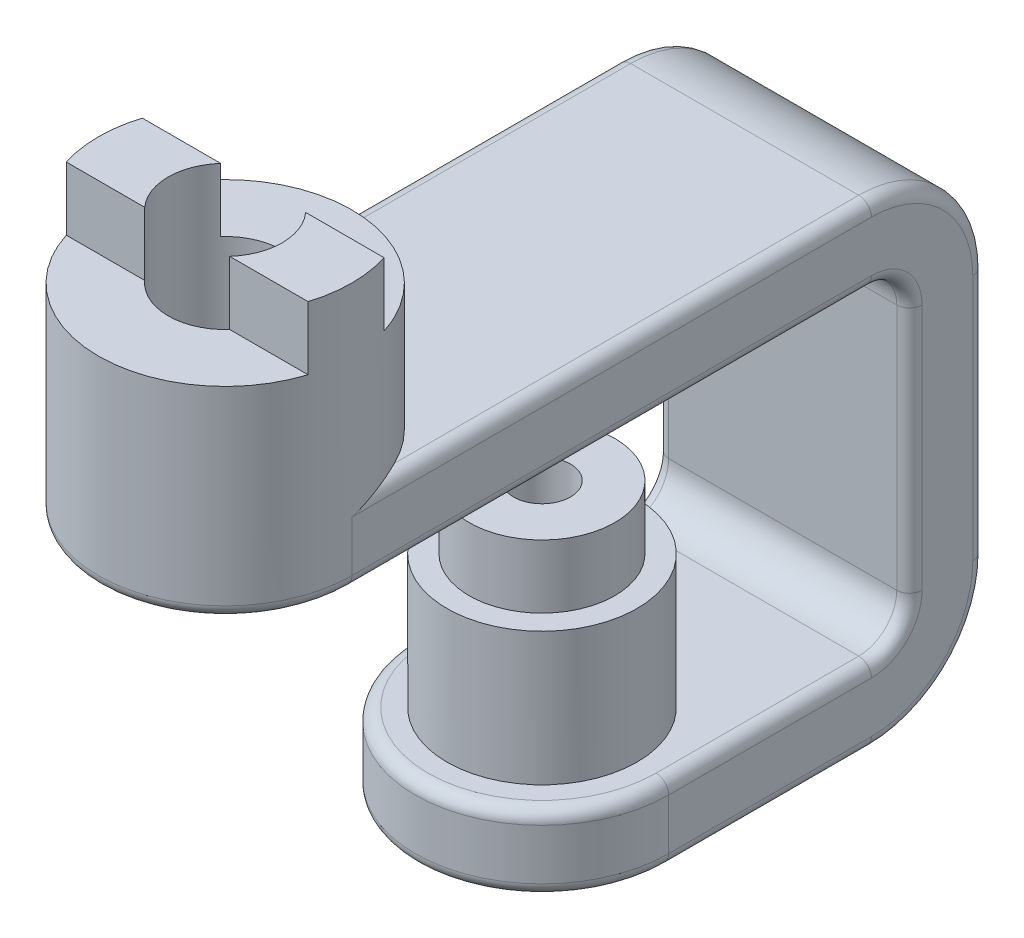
ISO-10303-21;
HEADER;
FILE_DESCRIPTION(('STEP AP214'),'2;1');
FILE_NAME('part.step','',(''),(''),'','','');
FILE_SCHEMA(('AUTOMOTIVE_DESIGN { 1 0 10303 214 1 1 1 1 }'));
ENDSEC;
DATA;
#1=APPLICATION_CONTEXT('core data for automotive mechanical design processes');
#2=APPLICATION_PROTOCOL_DEFINITION('international standard','automotive_design',2000,#1);
#3=PRODUCT_CONTEXT('',#1,'mechanical');
#4=PRODUCT('Part','Part','',(#3));
#5=PRODUCT_RELATED_PRODUCT_CATEGORY('part','',(#4));
#6=PRODUCT_DEFINITION_FORMATION('','',#4);
#7=PRODUCT_DEFINITION_CONTEXT('part definition',#1,'design');
#8=PRODUCT_DEFINITION('design','',#6,#7);
#9=PRODUCT_DEFINITION_SHAPE('','',#8);
#10=(LENGTH_UNIT() NAMED_UNIT(*) SI_UNIT(.MILLI.,.METRE.));
#11=(NAMED_UNIT(*) PLANE_ANGLE_UNIT() SI_UNIT($,.RADIAN.));
#12=(NAMED_UNIT(*) SI_UNIT($,.STERADIAN.) SOLID_ANGLE_UNIT());
#13=UNCERTAINTY_MEASURE_WITH_UNIT(LENGTH_MEASURE(1.E-05),#10,'distance_accuracy_value','');
#14=(GEOMETRIC_REPRESENTATION_CONTEXT(3) GLOBAL_UNCERTAINTY_ASSIGNED_CONTEXT((#13)) GLOBAL_UNIT_ASSIGNED_CONTEXT((#10,
#11,#12)) REPRESENTATION_CONTEXT('',''));
#15=CARTESIAN_POINT('',(0.,0.,0.));
#16=DIRECTION('',(0.,0.,1.));
#17=DIRECTION('',(1.,0.,0.));
#18=AXIS2_PLACEMENT_3D('',#15,#16,#17);
#19=CARTESIAN_POINT('',(20.,43.,-52.));
#20=DIRECTION('',(0.,-1.,0.));
#21=DIRECTION('',(0.,0.,-1.));
#22=AXIS2_PLACEMENT_3D('',#19,#20,#21);
#23=PLANE('',#22);
#24=CARTESIAN_POINT('',(0.,43.,-20.));
#25=DIRECTION('',(0.,-1.,0.));
#26=DIRECTION('',(0.,0.,-1.));
#27=AXIS2_PLACEMENT_3D('',#24,#25,#26);
#28=CIRCLE('',#27,11.5);
#29=CARTESIAN_POINT('',(0.,43.,-31.5));
#30=VERTEX_POINT('',#29);
#31=EDGE_CURVE('E283',#30,#30,#28,.T.);
#32=ORIENTED_EDGE('',*,*,#31,.F.);
#33=EDGE_LOOP('',(#32));
#34=FACE_BOUND('',#33,.T.);
#35=CARTESIAN_POINT('',(0.,43.,-20.));
#36=DIRECTION('',(0.,-1.,0.));
#37=DIRECTION('',(0.,0.,-1.));
#38=AXIS2_PLACEMENT_3D('',#35,#36,#37);
#39=CIRCLE('',#38,4.49999999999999);
#40=CARTESIAN_POINT('',(0.,43.,-24.5));
#41=VERTEX_POINT('',#40);
#42=EDGE_CURVE('E590',#41,#41,#39,.F.);
#43=ORIENTED_EDGE('',*,*,#42,.F.);
#44=EDGE_LOOP('',(#43));
#45=FACE_BOUND('',#44,.T.);
#46=ADVANCED_FACE('F36',(#34,#45),#23,.F.);
#47=CARTESIAN_POINT('',(0.,105.,30.));
#48=DIRECTION('',(0.,-1.,0.));
#49=DIRECTION('',(0.,0.,-1.));
#50=AXIS2_PLACEMENT_3D('',#47,#48,#49);
#51=PLANE('',#50);
#52=DIRECTION('',(1.,0.,0.));
#53=VECTOR('',#52,1.);
#54=CARTESIAN_POINT('',(-19.0787840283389,105.,24.));
#55=LINE('',#54,#53);
#56=CARTESIAN_POINT('',(6.70820393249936,105.,24.));
#57=VERTEX_POINT('',#56);
#58=CARTESIAN_POINT('',(19.0787840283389,105.,24.));
#59=VERTEX_POINT('',#58);
#60=EDGE_CURVE('E255',#57,#59,#55,.T.);
#61=ORIENTED_EDGE('',*,*,#60,.F.);
#62=CARTESIAN_POINT('',(0.,105.,30.));
#63=DIRECTION('',(0.,-1.,0.));
#64=DIRECTION('',(0.,0.,-1.));
#65=AXIS2_PLACEMENT_3D('',#62,#63,#64);
#66=CIRCLE('',#65,8.99999999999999);
#67=CARTESIAN_POINT('',(6.70820393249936,105.,36.));
#68=VERTEX_POINT('',#67);
#69=EDGE_CURVE('E247',#57,#68,#66,.T.);
#70=ORIENTED_EDGE('',*,*,#69,.T.);
#71=DIRECTION('',(-1.,0.,0.));
#72=VECTOR('',#71,1.);
#73=CARTESIAN_POINT('',(-19.0787840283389,105.,36.));
#74=LINE('',#73,#72);
#75=CARTESIAN_POINT('',(19.0787840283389,105.,36.));
#76=VERTEX_POINT('',#75);
#77=EDGE_CURVE('E263',#76,#68,#74,.T.);
#78=ORIENTED_EDGE('',*,*,#77,.F.);
#79=CARTESIAN_POINT('',(0.,105.,30.));
#80=DIRECTION('',(0.,-1.,0.));
#81=DIRECTION('',(0.,0.,-1.));
#82=AXIS2_PLACEMENT_3D('',#79,#80,#81);
#83=CIRCLE('',#82,20.);
#84=EDGE_CURVE('E293',#59,#76,#83,.T.);
#85=ORIENTED_EDGE('',*,*,#84,.F.);
#86=EDGE_LOOP('',(#61,#70,#78,#85));
#87=FACE_BOUND('',#86,.T.);
#88=ADVANCED_FACE('F261',(#87),#51,.F.);
#89=CARTESIAN_POINT('',(-19.0787840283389,95.,36.));
#90=DIRECTION('',(0.,0.,-1.));
#91=DIRECTION('',(-1.,0.,0.));
#92=AXIS2_PLACEMENT_3D('',#89,#90,#91);
#93=PLANE('',#92);
#94=ORIENTED_EDGE('',*,*,#77,.T.);
#95=DIRECTION('',(0.,-1.,0.));
#96=VECTOR('',#95,1.);
#97=CARTESIAN_POINT('',(6.70820393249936,63.,36.));
#98=LINE('',#97,#96);
#99=CARTESIAN_POINT('',(6.70820393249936,95.,36.));
#100=VERTEX_POINT('',#99);
#101=EDGE_CURVE('E244',#68,#100,#98,.T.);
#102=ORIENTED_EDGE('',*,*,#101,.T.);
#103=DIRECTION('',(-1.,0.,0.));
#104=VECTOR('',#103,1.);
#105=CARTESIAN_POINT('',(-19.0787840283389,95.,36.));
#106=LINE('',#105,#104);
#107=CARTESIAN_POINT('',(19.0787840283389,95.,36.));
#108=VERTEX_POINT('',#107);
#109=EDGE_CURVE('E279',#108,#100,#106,.T.);
#110=ORIENTED_EDGE('',*,*,#109,.F.);
#111=DIRECTION('',(0.,1.,0.));
#112=VECTOR('',#111,1.);
#113=CARTESIAN_POINT('',(19.0787840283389,95.,36.));
#114=LINE('',#113,#112);
#115=EDGE_CURVE('E270',#108,#76,#114,.T.);
#116=ORIENTED_EDGE('',*,*,#115,.T.);
#117=EDGE_LOOP('',(#94,#102,#110,#116));
#118=FACE_BOUND('',#117,.T.);
#119=ADVANCED_FACE('F268',(#118),#93,.F.);
#120=CARTESIAN_POINT('',(-19.0787840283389,95.,24.));
#121=DIRECTION('',(0.,0.,1.));
#122=DIRECTION('',(1.,0.,0.));
#123=AXIS2_PLACEMENT_3D('',#120,#121,#122);
#124=PLANE('',#123);
#125=CARTESIAN_POINT('',(-19.0787840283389,105.,24.));
#126=VERTEX_POINT('',#125);
#127=CARTESIAN_POINT('',(-6.70820393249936,105.,24.));
#128=VERTEX_POINT('',#127);
#129=EDGE_CURVE('E570',#126,#128,#55,.T.);
#130=ORIENTED_EDGE('',*,*,#129,.T.);
#131=DIRECTION('',(0.,-1.,0.));
#132=VECTOR('',#131,1.);
#133=CARTESIAN_POINT('',(-6.70820393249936,63.,24.));
#134=LINE('',#133,#132);
#135=CARTESIAN_POINT('',(-6.70820393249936,95.,24.));
#136=VERTEX_POINT('',#135);
#137=EDGE_CURVE('E341',#128,#136,#134,.T.);
#138=ORIENTED_EDGE('',*,*,#137,.T.);
#139=DIRECTION('',(1.,0.,0.));
#140=VECTOR('',#139,1.);
#141=CARTESIAN_POINT('',(-19.0787840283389,95.,24.));
#142=LINE('',#141,#140);
#143=CARTESIAN_POINT('',(-19.0787840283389,95.,24.));
#144=VERTEX_POINT('',#143);
#145=EDGE_CURVE('E571',#144,#136,#142,.T.);
#146=ORIENTED_EDGE('',*,*,#145,.F.);
#147=DIRECTION('',(0.,1.,0.));
#148=VECTOR('',#147,1.);
#149=CARTESIAN_POINT('',(-19.0787840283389,95.,24.));
#150=LINE('',#149,#148);
#151=EDGE_CURVE('E574',#144,#126,#150,.T.);
#152=ORIENTED_EDGE('',*,*,#151,.T.);
#153=EDGE_LOOP('',(#130,#138,#146,#152));
#154=FACE_BOUND('',#153,.T.);
#155=ADVANCED_FACE('F532',(#154),#124,.F.);
#156=CARTESIAN_POINT('',(20.,33.,-52.));
#157=DIRECTION('',(0.,-1.,0.));
#158=DIRECTION('',(0.,0.,-1.));
#159=AXIS2_PLACEMENT_3D('',#156,#157,#158);
#160=PLANE('',#159);
#161=CARTESIAN_POINT('',(0.,33.,-20.));
#162=DIRECTION('',(0.,-1.,0.));
#163=DIRECTION('',(0.,0.,-1.));
#164=AXIS2_PLACEMENT_3D('',#161,#162,#163);
#165=CIRCLE('',#164,15.);
#166=CARTESIAN_POINT('',(0.,33.,-35.));
#167=VERTEX_POINT('',#166);
#168=EDGE_CURVE('E290',#167,#167,#165,.T.);
#169=ORIENTED_EDGE('',*,*,#168,.F.);
#170=EDGE_LOOP('',(#169));
#171=FACE_BOUND('',#170,.T.);
#172=CARTESIAN_POINT('',(0.,33.,-20.));
#173=DIRECTION('',(0.,-1.,0.));
#174=DIRECTION('',(0.,0.,-1.));
#175=AXIS2_PLACEMENT_3D('',#172,#173,#174);
#176=CIRCLE('',#175,11.5);
#177=CARTESIAN_POINT('',(0.,33.,-31.5));
#178=VERTEX_POINT('',#177);
#179=EDGE_CURVE('E336',#178,#178,#176,.F.);
#180=ORIENTED_EDGE('',*,*,#179,.F.);
#181=EDGE_LOOP('',(#180));
#182=FACE_BOUND('',#181,.T.);
#183=ADVANCED_FACE('F489',(#171,#182),#160,.F.);
#184=CARTESIAN_POINT('',(20.,12.,0.));
#185=DIRECTION('',(0.,1.,0.));
#186=DIRECTION('',(0.,0.,1.));
#187=AXIS2_PLACEMENT_3D('',#184,#185,#186);
#188=PLANE('',#187);
#189=DIRECTION('',(-1.,0.,0.));
#190=VECTOR('',#189,1.);
#191=CARTESIAN_POINT('',(20.,12.,-52.));
#192=LINE('',#191,#190);
#193=CARTESIAN_POINT('',(18.,12.,-52.));
#194=VERTEX_POINT('',#193);
#195=CARTESIAN_POINT('',(-18.,12.,-52.));
#196=VERTEX_POINT('',#195);
#197=EDGE_CURVE('E318',#194,#196,#192,.T.);
#198=ORIENTED_EDGE('',*,*,#197,.T.);
#199=DIRECTION('',(0.,0.,-1.));
#200=VECTOR('',#199,1.);
#201=CARTESIAN_POINT('',(-18.,12.,-20.));
#202=LINE('',#201,#200);
#203=CARTESIAN_POINT('',(-18.,12.,-20.));
#204=VERTEX_POINT('',#203);
#205=EDGE_CURVE('E417',#196,#204,#202,.F.);
#206=ORIENTED_EDGE('',*,*,#205,.T.);
#207=CARTESIAN_POINT('',(0.,12.,-20.));
#208=DIRECTION('',(0.,1.,0.));
#209=DIRECTION('',(0.,0.,1.));
#210=AXIS2_PLACEMENT_3D('',#207,#208,#209);
#211=CIRCLE('',#210,18.);
#212=CARTESIAN_POINT('',(18.,12.,-20.));
#213=VERTEX_POINT('',#212);
#214=EDGE_CURVE('E414',#204,#213,#211,.T.);
#215=ORIENTED_EDGE('',*,*,#214,.T.);
#216=DIRECTION('',(0.,0.,-1.));
#217=VECTOR('',#216,1.);
#218=CARTESIAN_POINT('',(18.,12.,0.));
#219=LINE('',#218,#217);
#220=EDGE_CURVE('E412',#213,#194,#219,.T.);
#221=ORIENTED_EDGE('',*,*,#220,.T.);
#222=EDGE_LOOP('',(#198,#206,#215,#221));
#223=FACE_BOUND('',#222,.T.);
#224=CARTESIAN_POINT('',(0.,12.,-20.));
#225=DIRECTION('',(0.,1.,0.));
#226=DIRECTION('',(0.,0.,1.));
#227=AXIS2_PLACEMENT_3D('',#224,#225,#226);
#228=CIRCLE('',#227,15.);
#229=CARTESIAN_POINT('',(0.,12.,-5.));
#230=VERTEX_POINT('',#229);
#231=EDGE_CURVE('E287',#230,#230,#228,.T.);
#232=ORIENTED_EDGE('',*,*,#231,.F.);
#233=EDGE_LOOP('',(#232));
#234=FACE_BOUND('',#233,.T.);
#235=ADVANCED_FACE('F485',(#223,#234),#188,.T.);
#236=CARTESIAN_POINT('',(0.,12.,-20.));
#237=DIRECTION('',(0.,1.,0.));
#238=DIRECTION('',(0.,0.,1.));
#239=AXIS2_PLACEMENT_3D('',#236,#237,#238);
#240=CYLINDRICAL_SURFACE('',#239,20.);
#241=DIRECTION('',(0.,-1.,0.));
#242=VECTOR('',#241,1.);
#243=CARTESIAN_POINT('',(-20.,12.,-20.));
#244=LINE('',#243,#242);
#245=CARTESIAN_POINT('',(-20.,2.,-20.));
#246=VERTEX_POINT('',#245);
#247=CARTESIAN_POINT('',(-20.,10.,-20.));
#248=VERTEX_POINT('',#247);
#249=EDGE_CURVE('E333',#246,#248,#244,.F.);
#250=ORIENTED_EDGE('',*,*,#249,.F.);
#251=CARTESIAN_POINT('',(0.,2.,-20.));
#252=DIRECTION('',(0.,1.,0.));
#253=DIRECTION('',(0.,0.,1.));
#254=AXIS2_PLACEMENT_3D('',#251,#252,#253);
#255=CIRCLE('',#254,20.);
#256=CARTESIAN_POINT('',(20.,2.,-20.));
#257=VERTEX_POINT('',#256);
#258=EDGE_CURVE('E390',#246,#257,#255,.T.);
#259=ORIENTED_EDGE('',*,*,#258,.T.);
#260=DIRECTION('',(0.,1.,0.));
#261=VECTOR('',#260,1.);
#262=CARTESIAN_POINT('',(20.,57.,-20.));
#263=LINE('',#262,#261);
#264=CARTESIAN_POINT('',(20.,10.,-20.));
#265=VERTEX_POINT('',#264);
#266=EDGE_CURVE('E330',#265,#257,#263,.F.);
#267=ORIENTED_EDGE('',*,*,#266,.F.);
#268=CARTESIAN_POINT('',(0.,10.,-20.));
#269=DIRECTION('',(0.,1.,0.));
#270=DIRECTION('',(0.,0.,1.));
#271=AXIS2_PLACEMENT_3D('',#268,#269,#270);
#272=CIRCLE('',#271,20.);
#273=EDGE_CURVE('E387',#265,#248,#272,.F.);
#274=ORIENTED_EDGE('',*,*,#273,.T.);
#275=EDGE_LOOP('',(#250,#259,#267,#274));
#276=FACE_BOUND('',#275,.T.);
#277=ADVANCED_FACE('F488',(#276),#240,.T.);
#278=CARTESIAN_POINT('',(20.,75.,-52.));
#279=DIRECTION('',(0.,-1.,0.));
#280=DIRECTION('',(0.,0.,-1.));
#281=AXIS2_PLACEMENT_3D('',#278,#279,#280);
#282=PLANE('',#281);
#283=DIRECTION('',(-1.,0.,0.));
#284=VECTOR('',#283,1.);
#285=CARTESIAN_POINT('',(20.,75.,-52.));
#286=LINE('',#285,#284);
#287=CARTESIAN_POINT('',(18.,75.,-52.));
#288=VERTEX_POINT('',#287);
#289=CARTESIAN_POINT('',(-18.,75.,-52.));
#290=VERTEX_POINT('',#289);
#291=EDGE_CURVE('E304',#288,#290,#286,.T.);
#292=ORIENTED_EDGE('',*,*,#291,.T.);
#293=DIRECTION('',(0.,0.,1.));
#294=VECTOR('',#293,1.);
#295=CARTESIAN_POINT('',(-18.,75.,-52.));
#296=LINE('',#295,#294);
#297=CARTESIAN_POINT('',(-18.,75.,21.2822021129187));
#298=VERTEX_POINT('',#297);
#299=EDGE_CURVE('E346',#290,#298,#296,.T.);
#300=ORIENTED_EDGE('',*,*,#299,.T.);
#301=CARTESIAN_POINT('',(0.,75.,30.));
#302=DIRECTION('',(0.,-1.,0.));
#303=DIRECTION('',(0.,0.,-1.));
#304=AXIS2_PLACEMENT_3D('',#301,#302,#303);
#305=CIRCLE('',#304,20.);
#306=CARTESIAN_POINT('',(18.,75.,21.2822021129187));
#307=VERTEX_POINT('',#306);
#308=EDGE_CURVE('E297',#298,#307,#305,.T.);
#309=ORIENTED_EDGE('',*,*,#308,.T.);
#310=DIRECTION('',(0.,0.,1.));
#311=VECTOR('',#310,1.);
#312=CARTESIAN_POINT('',(18.,75.,-52.));
#313=LINE('',#312,#311);
#314=EDGE_CURVE('E344',#307,#288,#313,.F.);
#315=ORIENTED_EDGE('',*,*,#314,.T.);
#316=EDGE_LOOP('',(#292,#300,#309,#315));
#317=FACE_BOUND('',#316,.T.);
#318=ADVANCED_FACE('F505',(#317),#282,.F.);
#319=CARTESIAN_POINT('',(20.,63.,-52.));
#320=DIRECTION('',(0.,-1.,0.));
#321=DIRECTION('',(0.,0.,-1.));
#322=AXIS2_PLACEMENT_3D('',#319,#320,#321);
#323=PLANE('',#322);
#324=CARTESIAN_POINT('',(0.,63.,30.));
#325=DIRECTION('',(0.,-1.,0.));
#326=DIRECTION('',(0.,0.,-1.));
#327=AXIS2_PLACEMENT_3D('',#324,#325,#326);
#328=CIRCLE('',#327,8.99999999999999);
#329=CARTESIAN_POINT('',(0.,63.,21.));
#330=VERTEX_POINT('',#329);
#331=EDGE_CURVE('E588',#330,#330,#328,.T.);
#332=ORIENTED_EDGE('',*,*,#331,.F.);
#333=EDGE_LOOP('',(#332));
#334=FACE_BOUND('',#333,.T.);
#335=CARTESIAN_POINT('',(0.,63.,30.));
#336=DIRECTION('',(0.,-1.,0.));
#337=DIRECTION('',(0.,0.,-1.));
#338=AXIS2_PLACEMENT_3D('',#335,#336,#337);
#339=CIRCLE('',#338,18.);
#340=CARTESIAN_POINT('',(18.,63.,30.));
#341=VERTEX_POINT('',#340);
#342=CARTESIAN_POINT('',(-18.,63.,30.));
#343=VERTEX_POINT('',#342);
#344=EDGE_CURVE('E53',#341,#343,#339,.T.);
#345=ORIENTED_EDGE('',*,*,#344,.T.);
#346=DIRECTION('',(0.,0.,1.));
#347=VECTOR('',#346,1.);
#348=CARTESIAN_POINT('',(-18.,63.,-52.));
#349=LINE('',#348,#347);
#350=CARTESIAN_POINT('',(-18.,63.,-52.));
#351=VERTEX_POINT('',#350);
#352=EDGE_CURVE('E433',#343,#351,#349,.F.);
#353=ORIENTED_EDGE('',*,*,#352,.T.);
#354=DIRECTION('',(-1.,0.,0.));
#355=VECTOR('',#354,1.);
#356=CARTESIAN_POINT('',(20.,63.,-52.));
#357=LINE('',#356,#355);
#358=CARTESIAN_POINT('',(18.,63.,-52.));
#359=VERTEX_POINT('',#358);
#360=EDGE_CURVE('E327',#359,#351,#357,.T.);
#361=ORIENTED_EDGE('',*,*,#360,.F.);
#362=DIRECTION('',(0.,0.,1.));
#363=VECTOR('',#362,1.);
#364=CARTESIAN_POINT('',(18.,63.,-52.));
#365=LINE('',#364,#363);
#366=EDGE_CURVE('E58',#359,#341,#365,.T.);
#367=ORIENTED_EDGE('',*,*,#366,.T.);
#368=EDGE_LOOP('',(#345,#353,#361,#367));
#369=FACE_BOUND('',#368,.T.);
#370=ADVANCED_FACE('F501',(#334,#369),#323,.T.);
#371=CARTESIAN_POINT('',(20.,57.,-52.));
#372=DIRECTION('',(-1.,0.,0.));
#373=DIRECTION('',(0.,0.,1.));
#374=AXIS2_PLACEMENT_3D('',#371,#372,#373);
#375=CYLINDRICAL_SURFACE('',#374,6.);
#376=ORIENTED_EDGE('',*,*,#360,.T.);
#377=CARTESIAN_POINT('',(-18.,57.,-52.));
#378=DIRECTION('',(1.,0.,0.));
#379=DIRECTION('',(0.,0.,-1.));
#380=AXIS2_PLACEMENT_3D('',#377,#378,#379);
#381=CIRCLE('',#380,6.);
#382=CARTESIAN_POINT('',(-18.,57.,-58.));
#383=VERTEX_POINT('',#382);
#384=EDGE_CURVE('E429',#351,#383,#381,.F.);
#385=ORIENTED_EDGE('',*,*,#384,.T.);
#386=DIRECTION('',(-1.,0.,0.));
#387=VECTOR('',#386,1.);
#388=CARTESIAN_POINT('',(20.,57.,-58.));
#389=LINE('',#388,#387);
#390=CARTESIAN_POINT('',(18.,57.,-58.));
#391=VERTEX_POINT('',#390);
#392=EDGE_CURVE('E324',#391,#383,#389,.T.);
#393=ORIENTED_EDGE('',*,*,#392,.F.);
#394=CARTESIAN_POINT('',(18.,57.,-52.));
#395=DIRECTION('',(1.,0.,0.));
#396=DIRECTION('',(0.,0.,-1.));
#397=AXIS2_PLACEMENT_3D('',#394,#395,#396);
#398=CIRCLE('',#397,6.);
#399=EDGE_CURVE('E427',#391,#359,#398,.T.);
#400=ORIENTED_EDGE('',*,*,#399,.T.);
#401=EDGE_LOOP('',(#376,#385,#393,#400));
#402=FACE_BOUND('',#401,.T.);
#403=ADVANCED_FACE('F497',(#402),#375,.F.);
#404=CARTESIAN_POINT('',(20.,18.,-58.));
#405=DIRECTION('',(0.,0.,1.));
#406=DIRECTION('',(1.,0.,0.));
#407=AXIS2_PLACEMENT_3D('',#404,#405,#406);
#408=PLANE('',#407);
#409=ORIENTED_EDGE('',*,*,#392,.T.);
#410=DIRECTION('',(0.,1.,0.));
#411=VECTOR('',#410,1.);
#412=CARTESIAN_POINT('',(-18.,18.,-58.));
#413=LINE('',#412,#411);
#414=CARTESIAN_POINT('',(-18.,18.,-58.));
#415=VERTEX_POINT('',#414);
#416=EDGE_CURVE('E425',#383,#415,#413,.F.);
#417=ORIENTED_EDGE('',*,*,#416,.T.);
#418=DIRECTION('',(-1.,0.,0.));
#419=VECTOR('',#418,1.);
#420=CARTESIAN_POINT('',(20.,18.,-58.));
#421=LINE('',#420,#419);
#422=CARTESIAN_POINT('',(18.,18.,-58.));
#423=VERTEX_POINT('',#422);
#424=EDGE_CURVE('E321',#423,#415,#421,.T.);
#425=ORIENTED_EDGE('',*,*,#424,.F.);
#426=DIRECTION('',(0.,1.,0.));
#427=VECTOR('',#426,1.);
#428=CARTESIAN_POINT('',(18.,18.,-58.));
#429=LINE('',#428,#427);
#430=EDGE_CURVE('E423',#423,#391,#429,.T.);
#431=ORIENTED_EDGE('',*,*,#430,.T.);
#432=EDGE_LOOP('',(#409,#417,#425,#431));
#433=FACE_BOUND('',#432,.T.);
#434=ADVANCED_FACE('F493',(#433),#408,.T.);
#435=CARTESIAN_POINT('',(20.,18.,-52.));
#436=DIRECTION('',(-1.,0.,0.));
#437=DIRECTION('',(0.,0.,1.));
#438=AXIS2_PLACEMENT_3D('',#435,#436,#437);
#439=CYLINDRICAL_SURFACE('',#438,5.99999999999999);
#440=ORIENTED_EDGE('',*,*,#424,.T.);
#441=CARTESIAN_POINT('',(-18.,18.,-52.));
#442=DIRECTION('',(1.,0.,0.));
#443=DIRECTION('',(0.,0.,-1.));
#444=AXIS2_PLACEMENT_3D('',#441,#442,#443);
#445=CIRCLE('',#444,5.99999999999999);
#446=EDGE_CURVE('E421',#415,#196,#445,.F.);
#447=ORIENTED_EDGE('',*,*,#446,.T.);
#448=ORIENTED_EDGE('',*,*,#197,.F.);
#449=CARTESIAN_POINT('',(18.,18.,-52.));
#450=DIRECTION('',(1.,0.,0.));
#451=DIRECTION('',(0.,0.,-1.));
#452=AXIS2_PLACEMENT_3D('',#449,#450,#451);
#453=CIRCLE('',#452,5.99999999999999);
#454=EDGE_CURVE('E419',#194,#423,#453,.T.);
#455=ORIENTED_EDGE('',*,*,#454,.T.);
#456=EDGE_LOOP('',(#440,#447,#448,#455));
#457=FACE_BOUND('',#456,.T.);
#458=ADVANCED_FACE('F483',(#457),#439,.F.);
#459=CARTESIAN_POINT('',(20.,0.,0.));
#460=DIRECTION('',(0.,1.,0.));
#461=DIRECTION('',(0.,0.,1.));
#462=AXIS2_PLACEMENT_3D('',#459,#460,#461);
#463=PLANE('',#462);
#464=CARTESIAN_POINT('',(0.,0.,-20.));
#465=DIRECTION('',(0.,-1.,0.));
#466=DIRECTION('',(0.,0.,-1.));
#467=AXIS2_PLACEMENT_3D('',#464,#465,#466);
#468=CIRCLE('',#467,9.005);
#469=CARTESIAN_POINT('',(0.,0.,-29.005));
#470=VERTEX_POINT('',#469);
#471=EDGE_CURVE('E599',#470,#470,#468,.T.);
#472=ORIENTED_EDGE('',*,*,#471,.F.);
#473=EDGE_LOOP('',(#472));
#474=FACE_BOUND('',#473,.T.);
#475=CARTESIAN_POINT('',(0.,0.,-20.));
#476=DIRECTION('',(0.,1.,0.));
#477=DIRECTION('',(0.,0.,1.));
#478=AXIS2_PLACEMENT_3D('',#475,#476,#477);
#479=CIRCLE('',#478,18.);
#480=CARTESIAN_POINT('',(18.,0.,-20.));
#481=VERTEX_POINT('',#480);
#482=CARTESIAN_POINT('',(-18.,0.,-20.));
#483=VERTEX_POINT('',#482);
#484=EDGE_CURVE('E383',#481,#483,#479,.F.);
#485=ORIENTED_EDGE('',*,*,#484,.T.);
#486=DIRECTION('',(0.,0.,-1.));
#487=VECTOR('',#486,1.);
#488=CARTESIAN_POINT('',(-18.,0.,0.));
#489=LINE('',#488,#487);
#490=CARTESIAN_POINT('',(-18.,0.,-52.));
#491=VERTEX_POINT('',#490);
#492=EDGE_CURVE('E385',#483,#491,#489,.T.);
#493=ORIENTED_EDGE('',*,*,#492,.T.);
#494=DIRECTION('',(-1.,0.,0.));
#495=VECTOR('',#494,1.);
#496=CARTESIAN_POINT('',(20.,0.,-52.));
#497=LINE('',#496,#495);
#498=CARTESIAN_POINT('',(18.,0.,-52.));
#499=VERTEX_POINT('',#498);
#500=EDGE_CURVE('E315',#499,#491,#497,.T.);
#501=ORIENTED_EDGE('',*,*,#500,.F.);
#502=DIRECTION('',(0.,0.,-1.));
#503=VECTOR('',#502,1.);
#504=CARTESIAN_POINT('',(18.,0.,-20.));
#505=LINE('',#504,#503);
#506=EDGE_CURVE('E381',#499,#481,#505,.F.);
#507=ORIENTED_EDGE('',*,*,#506,.T.);
#508=EDGE_LOOP('',(#485,#493,#501,#507));
#509=FACE_BOUND('',#508,.T.);
#510=ADVANCED_FACE('F479',(#474,#509),#463,.F.);
#511=CARTESIAN_POINT('',(20.,18.,-52.));
#512=DIRECTION('',(-1.,0.,0.));
#513=DIRECTION('',(0.,0.,1.));
#514=AXIS2_PLACEMENT_3D('',#511,#512,#513);
#515=CYLINDRICAL_SURFACE('',#514,18.);
#516=ORIENTED_EDGE('',*,*,#500,.T.);
#517=CARTESIAN_POINT('',(-18.,18.,-52.));
#518=DIRECTION('',(1.,0.,0.));
#519=DIRECTION('',(0.,0.,-1.));
#520=AXIS2_PLACEMENT_3D('',#517,#518,#519);
#521=CIRCLE('',#520,18.);
#522=CARTESIAN_POINT('',(-18.,18.,-70.));
#523=VERTEX_POINT('',#522);
#524=EDGE_CURVE('E379',#491,#523,#521,.T.);
#525=ORIENTED_EDGE('',*,*,#524,.T.);
#526=DIRECTION('',(-1.,0.,0.));
#527=VECTOR('',#526,1.);
#528=CARTESIAN_POINT('',(20.,18.,-70.));
#529=LINE('',#528,#527);
#530=CARTESIAN_POINT('',(18.,18.,-70.));
#531=VERTEX_POINT('',#530);
#532=EDGE_CURVE('E312',#531,#523,#529,.T.);
#533=ORIENTED_EDGE('',*,*,#532,.F.);
#534=CARTESIAN_POINT('',(18.,18.,-52.));
#535=DIRECTION('',(1.,0.,0.));
#536=DIRECTION('',(0.,0.,-1.));
#537=AXIS2_PLACEMENT_3D('',#534,#535,#536);
#538=CIRCLE('',#537,18.);
#539=EDGE_CURVE('E377',#531,#499,#538,.F.);
#540=ORIENTED_EDGE('',*,*,#539,.T.);
#541=EDGE_LOOP('',(#516,#525,#533,#540));
#542=FACE_BOUND('',#541,.T.);
#543=ADVANCED_FACE('F475',(#542),#515,.T.);
#544=CARTESIAN_POINT('',(20.,18.,-70.));
#545=DIRECTION('',(0.,0.,1.));
#546=DIRECTION('',(1.,0.,0.));
#547=AXIS2_PLACEMENT_3D('',#544,#545,#546);
#548=PLANE('',#547);
#549=ORIENTED_EDGE('',*,*,#532,.T.);
#550=DIRECTION('',(0.,1.,0.));
#551=VECTOR('',#550,1.);
#552=CARTESIAN_POINT('',(-18.,18.,-70.));
#553=LINE('',#552,#551);
#554=CARTESIAN_POINT('',(-18.,57.,-70.));
#555=VERTEX_POINT('',#554);
#556=EDGE_CURVE('E375',#523,#555,#553,.T.);
#557=ORIENTED_EDGE('',*,*,#556,.T.);
#558=DIRECTION('',(-1.,0.,0.));
#559=VECTOR('',#558,1.);
#560=CARTESIAN_POINT('',(20.,57.,-70.));
#561=LINE('',#560,#559);
#562=CARTESIAN_POINT('',(18.,57.,-70.));
#563=VERTEX_POINT('',#562);
#564=EDGE_CURVE('E309',#563,#555,#561,.T.);
#565=ORIENTED_EDGE('',*,*,#564,.F.);
#566=DIRECTION('',(0.,1.,0.));
#567=VECTOR('',#566,1.);
#568=CARTESIAN_POINT('',(18.,18.,-70.));
#569=LINE('',#568,#567);
#570=EDGE_CURVE('E373',#563,#531,#569,.F.);
#571=ORIENTED_EDGE('',*,*,#570,.T.);
#572=EDGE_LOOP('',(#549,#557,#565,#571));
#573=FACE_BOUND('',#572,.T.);
#574=ADVANCED_FACE('F471',(#573),#548,.F.);
#575=CARTESIAN_POINT('',(20.,57.,-52.));
#576=DIRECTION('',(-1.,0.,0.));
#577=DIRECTION('',(0.,0.,1.));
#578=AXIS2_PLACEMENT_3D('',#575,#576,#577);
#579=CYLINDRICAL_SURFACE('',#578,18.);
#580=ORIENTED_EDGE('',*,*,#564,.T.);
#581=CARTESIAN_POINT('',(-18.,57.,-52.));
#582=DIRECTION('',(1.,0.,0.));
#583=DIRECTION('',(0.,0.,-1.));
#584=AXIS2_PLACEMENT_3D('',#581,#582,#583);
#585=CIRCLE('',#584,18.);
#586=EDGE_CURVE('E371',#555,#290,#585,.T.);
#587=ORIENTED_EDGE('',*,*,#586,.T.);
#588=ORIENTED_EDGE('',*,*,#291,.F.);
#589=CARTESIAN_POINT('',(18.,57.,-52.));
#590=DIRECTION('',(1.,0.,0.));
#591=DIRECTION('',(0.,0.,-1.));
#592=AXIS2_PLACEMENT_3D('',#589,#590,#591);
#593=CIRCLE('',#592,18.);
#594=EDGE_CURVE('E369',#288,#563,#593,.F.);
#595=ORIENTED_EDGE('',*,*,#594,.T.);
#596=EDGE_LOOP('',(#580,#587,#588,#595));
#597=FACE_BOUND('',#596,.T.);
#598=ADVANCED_FACE('F464',(#597),#579,.T.);
#599=CARTESIAN_POINT('',(20.,57.,-52.));
#600=DIRECTION('',(1.,0.,0.));
#601=DIRECTION('',(0.,0.,-1.));
#602=AXIS2_PLACEMENT_3D('',#599,#600,#601);
#603=PLANE('',#602);
#604=CARTESIAN_POINT('',(20.,57.,-52.));
#605=DIRECTION('',(1.,0.,0.));
#606=DIRECTION('',(0.,0.,-1.));
#607=AXIS2_PLACEMENT_3D('',#604,#605,#606);
#608=CIRCLE('',#607,16.);
#609=CARTESIAN_POINT('',(20.,57.,-68.));
#610=VERTEX_POINT('',#609);
#611=CARTESIAN_POINT('',(20.,73.,-52.));
#612=VERTEX_POINT('',#611);
#613=EDGE_CURVE('E408',#610,#612,#608,.T.);
#614=ORIENTED_EDGE('',*,*,#613,.T.);
#615=DIRECTION('',(0.,0.,1.));
#616=VECTOR('',#615,1.);
#617=CARTESIAN_POINT('',(20.,73.,30.));
#618=LINE('',#617,#616);
#619=CARTESIAN_POINT('',(20.,73.,30.));
#620=VERTEX_POINT('',#619);
#621=EDGE_CURVE('E410',#612,#620,#618,.T.);
#622=ORIENTED_EDGE('',*,*,#621,.T.);
#623=DIRECTION('',(0.,1.,0.));
#624=VECTOR('',#623,1.);
#625=CARTESIAN_POINT('',(20.,63.,30.));
#626=LINE('',#625,#624);
#627=CARTESIAN_POINT('',(20.,65.,30.));
#628=VERTEX_POINT('',#627);
#629=EDGE_CURVE('E301',#628,#620,#626,.T.);
#630=ORIENTED_EDGE('',*,*,#629,.F.);
#631=DIRECTION('',(0.,0.,1.));
#632=VECTOR('',#631,1.);
#633=CARTESIAN_POINT('',(20.,65.,-52.));
#634=LINE('',#633,#632);
#635=CARTESIAN_POINT('',(20.,65.,-52.));
#636=VERTEX_POINT('',#635);
#637=EDGE_CURVE('E400',#628,#636,#634,.F.);
#638=ORIENTED_EDGE('',*,*,#637,.T.);
#639=CARTESIAN_POINT('',(20.,57.,-52.));
#640=DIRECTION('',(1.,0.,0.));
#641=DIRECTION('',(0.,0.,-1.));
#642=AXIS2_PLACEMENT_3D('',#639,#640,#641);
#643=CIRCLE('',#642,8.);
#644=CARTESIAN_POINT('',(20.,57.,-60.));
#645=VERTEX_POINT('',#644);
#646=EDGE_CURVE('E398',#636,#645,#643,.F.);
#647=ORIENTED_EDGE('',*,*,#646,.T.);
#648=DIRECTION('',(0.,1.,0.));
#649=VECTOR('',#648,1.);
#650=CARTESIAN_POINT('',(20.,57.,-60.));
#651=LINE('',#650,#649);
#652=CARTESIAN_POINT('',(20.,18.,-60.));
#653=VERTEX_POINT('',#652);
#654=EDGE_CURVE('E396',#645,#653,#651,.F.);
#655=ORIENTED_EDGE('',*,*,#654,.T.);
#656=CARTESIAN_POINT('',(20.,18.,-52.));
#657=DIRECTION('',(1.,0.,0.));
#658=DIRECTION('',(0.,0.,-1.));
#659=AXIS2_PLACEMENT_3D('',#656,#657,#658);
#660=CIRCLE('',#659,7.99999999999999);
#661=CARTESIAN_POINT('',(20.,10.,-52.));
#662=VERTEX_POINT('',#661);
#663=EDGE_CURVE('E394',#653,#662,#660,.F.);
#664=ORIENTED_EDGE('',*,*,#663,.T.);
#665=DIRECTION('',(0.,0.,-1.));
#666=VECTOR('',#665,1.);
#667=CARTESIAN_POINT('',(20.,10.,-52.));
#668=LINE('',#667,#666);
#669=EDGE_CURVE('E392',#662,#265,#668,.F.);
#670=ORIENTED_EDGE('',*,*,#669,.T.);
#671=ORIENTED_EDGE('',*,*,#266,.T.);
#672=DIRECTION('',(0.,0.,-1.));
#673=VECTOR('',#672,1.);
#674=CARTESIAN_POINT('',(20.,2.,-52.));
#675=LINE('',#674,#673);
#676=CARTESIAN_POINT('',(20.,2.,-52.));
#677=VERTEX_POINT('',#676);
#678=EDGE_CURVE('E402',#257,#677,#675,.T.);
#679=ORIENTED_EDGE('',*,*,#678,.T.);
#680=CARTESIAN_POINT('',(20.,18.,-52.));
#681=DIRECTION('',(1.,0.,0.));
#682=DIRECTION('',(0.,0.,-1.));
#683=AXIS2_PLACEMENT_3D('',#680,#681,#682);
#684=CIRCLE('',#683,16.);
#685=CARTESIAN_POINT('',(20.,18.,-68.));
#686=VERTEX_POINT('',#685);
#687=EDGE_CURVE('E404',#677,#686,#684,.T.);
#688=ORIENTED_EDGE('',*,*,#687,.T.);
#689=DIRECTION('',(0.,1.,0.));
#690=VECTOR('',#689,1.);
#691=CARTESIAN_POINT('',(20.,57.,-68.));
#692=LINE('',#691,#690);
#693=EDGE_CURVE('E406',#686,#610,#692,.T.);
#694=ORIENTED_EDGE('',*,*,#693,.T.);
#695=EDGE_LOOP('',(#614,#622,#630,#638,#647,#655,#664,#670,#671,#679,#688,#694));
#696=FACE_BOUND('',#695,.T.);
#697=ADVANCED_FACE('F460',(#696),#603,.T.);
#698=CARTESIAN_POINT('',(-20.,57.,-52.));
#699=DIRECTION('',(1.,0.,0.));
#700=DIRECTION('',(0.,0.,-1.));
#701=AXIS2_PLACEMENT_3D('',#698,#699,#700);
#702=PLANE('',#701);
#703=DIRECTION('',(0.,1.,0.));
#704=VECTOR('',#703,1.);
#705=CARTESIAN_POINT('',(-20.,63.,30.));
#706=LINE('',#705,#704);
#707=CARTESIAN_POINT('',(-20.,65.,30.));
#708=VERTEX_POINT('',#707);
#709=CARTESIAN_POINT('',(-20.,73.,30.));
#710=VERTEX_POINT('',#709);
#711=EDGE_CURVE('E300',#708,#710,#706,.T.);
#712=ORIENTED_EDGE('',*,*,#711,.T.);
#713=DIRECTION('',(0.,0.,1.));
#714=VECTOR('',#713,1.);
#715=CARTESIAN_POINT('',(-20.,73.,-52.));
#716=LINE('',#715,#714);
#717=CARTESIAN_POINT('',(-20.,73.,-52.));
#718=VERTEX_POINT('',#717);
#719=EDGE_CURVE('E367',#710,#718,#716,.F.);
#720=ORIENTED_EDGE('',*,*,#719,.T.);
#721=CARTESIAN_POINT('',(-20.,57.,-52.));
#722=DIRECTION('',(1.,0.,0.));
#723=DIRECTION('',(0.,0.,-1.));
#724=AXIS2_PLACEMENT_3D('',#721,#722,#723);
#725=CIRCLE('',#724,16.);
#726=CARTESIAN_POINT('',(-20.,57.,-68.));
#727=VERTEX_POINT('',#726);
#728=EDGE_CURVE('E365',#718,#727,#725,.F.);
#729=ORIENTED_EDGE('',*,*,#728,.T.);
#730=DIRECTION('',(0.,1.,0.));
#731=VECTOR('',#730,1.);
#732=CARTESIAN_POINT('',(-20.,57.,-68.));
#733=LINE('',#732,#731);
#734=CARTESIAN_POINT('',(-20.,18.,-68.));
#735=VERTEX_POINT('',#734);
#736=EDGE_CURVE('E363',#727,#735,#733,.F.);
#737=ORIENTED_EDGE('',*,*,#736,.T.);
#738=CARTESIAN_POINT('',(-20.,18.,-52.));
#739=DIRECTION('',(1.,0.,0.));
#740=DIRECTION('',(0.,0.,-1.));
#741=AXIS2_PLACEMENT_3D('',#738,#739,#740);
#742=CIRCLE('',#741,16.);
#743=CARTESIAN_POINT('',(-20.,2.,-52.));
#744=VERTEX_POINT('',#743);
#745=EDGE_CURVE('E361',#735,#744,#742,.F.);
#746=ORIENTED_EDGE('',*,*,#745,.T.);
#747=DIRECTION('',(0.,0.,-1.));
#748=VECTOR('',#747,1.);
#749=CARTESIAN_POINT('',(-20.,2.,-52.));
#750=LINE('',#749,#748);
#751=EDGE_CURVE('E359',#744,#246,#750,.F.);
#752=ORIENTED_EDGE('',*,*,#751,.T.);
#753=ORIENTED_EDGE('',*,*,#249,.T.);
#754=DIRECTION('',(0.,0.,-1.));
#755=VECTOR('',#754,1.);
#756=CARTESIAN_POINT('',(-20.,10.,-52.));
#757=LINE('',#756,#755);
#758=CARTESIAN_POINT('',(-20.,10.,-52.));
#759=VERTEX_POINT('',#758);
#760=EDGE_CURVE('E357',#248,#759,#757,.T.);
#761=ORIENTED_EDGE('',*,*,#760,.T.);
#762=CARTESIAN_POINT('',(-20.,18.,-52.));
#763=DIRECTION('',(1.,0.,0.));
#764=DIRECTION('',(0.,0.,-1.));
#765=AXIS2_PLACEMENT_3D('',#762,#763,#764);
#766=CIRCLE('',#765,7.99999999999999);
#767=CARTESIAN_POINT('',(-20.,18.,-60.));
#768=VERTEX_POINT('',#767);
#769=EDGE_CURVE('E355',#759,#768,#766,.T.);
#770=ORIENTED_EDGE('',*,*,#769,.T.);
#771=DIRECTION('',(0.,1.,0.));
#772=VECTOR('',#771,1.);
#773=CARTESIAN_POINT('',(-20.,57.,-60.));
#774=LINE('',#773,#772);
#775=CARTESIAN_POINT('',(-20.,57.,-60.));
#776=VERTEX_POINT('',#775);
#777=EDGE_CURVE('E353',#768,#776,#774,.T.);
#778=ORIENTED_EDGE('',*,*,#777,.T.);
#779=CARTESIAN_POINT('',(-20.,57.,-52.));
#780=DIRECTION('',(1.,0.,0.));
#781=DIRECTION('',(0.,0.,-1.));
#782=AXIS2_PLACEMENT_3D('',#779,#780,#781);
#783=CIRCLE('',#782,8.);
#784=CARTESIAN_POINT('',(-20.,65.,-52.));
#785=VERTEX_POINT('',#784);
#786=EDGE_CURVE('E351',#776,#785,#783,.T.);
#787=ORIENTED_EDGE('',*,*,#786,.T.);
#788=DIRECTION('',(0.,0.,1.));
#789=VECTOR('',#788,1.);
#790=CARTESIAN_POINT('',(-20.,65.,30.));
#791=LINE('',#790,#789);
#792=EDGE_CURVE('E349',#785,#708,#791,.T.);
#793=ORIENTED_EDGE('',*,*,#792,.T.);
#794=EDGE_LOOP('',(#712,#720,#729,#737,#746,#752,#753,#761,#770,#778,#787,#793));
#795=FACE_BOUND('',#794,.T.);
#796=ADVANCED_FACE('F457',(#795),#702,.F.);
#797=CARTESIAN_POINT('',(0.,105.,30.));
#798=DIRECTION('',(0.,-1.,0.));
#799=DIRECTION('',(0.,0.,-1.));
#800=AXIS2_PLACEMENT_3D('',#797,#798,#799);
#801=CYLINDRICAL_SURFACE('',#800,20.);
#802=ORIENTED_EDGE('',*,*,#151,.F.);
#803=CARTESIAN_POINT('',(0.,95.,30.));
#804=DIRECTION('',(0.,1.,0.));
#805=DIRECTION('',(0.,0.,1.));
#806=AXIS2_PLACEMENT_3D('',#803,#804,#805);
#807=CIRCLE('',#806,20.);
#808=CARTESIAN_POINT('',(19.0787840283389,95.,24.));
#809=VERTEX_POINT('',#808);
#810=EDGE_CURVE('E567',#809,#144,#807,.T.);
#811=ORIENTED_EDGE('',*,*,#810,.F.);
#812=DIRECTION('',(0.,1.,0.));
#813=VECTOR('',#812,1.);
#814=CARTESIAN_POINT('',(19.0787840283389,95.,24.));
#815=LINE('',#814,#813);
#816=EDGE_CURVE('E276',#809,#59,#815,.T.);
#817=ORIENTED_EDGE('',*,*,#816,.T.);
#818=ORIENTED_EDGE('',*,*,#84,.T.);
#819=ORIENTED_EDGE('',*,*,#115,.F.);
#820=CARTESIAN_POINT('',(0.,95.,30.));
#821=DIRECTION('',(0.,1.,0.));
#822=DIRECTION('',(0.,0.,1.));
#823=AXIS2_PLACEMENT_3D('',#820,#821,#822);
#824=CIRCLE('',#823,20.);
#825=CARTESIAN_POINT('',(-19.0787840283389,95.,36.));
#826=VERTEX_POINT('',#825);
#827=EDGE_CURVE('E271',#826,#108,#824,.T.);
#828=ORIENTED_EDGE('',*,*,#827,.F.);
#829=DIRECTION('',(0.,1.,0.));
#830=VECTOR('',#829,1.);
#831=CARTESIAN_POINT('',(-19.0787840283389,95.,36.));
#832=LINE('',#831,#830);
#833=CARTESIAN_POINT('',(-19.0787840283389,105.,36.));
#834=VERTEX_POINT('',#833);
#835=EDGE_CURVE('E280',#826,#834,#832,.T.);
#836=ORIENTED_EDGE('',*,*,#835,.T.);
#837=EDGE_CURVE('E294',#834,#126,#83,.T.);
#838=ORIENTED_EDGE('',*,*,#837,.T.);
#839=EDGE_LOOP('',(#802,#811,#817,#818,#819,#828,#836,#838));
#840=FACE_BOUND('',#839,.T.);
#841=ORIENTED_EDGE('',*,*,#711,.F.);
#842=CARTESIAN_POINT('',(0.,65.,30.));
#843=DIRECTION('',(0.,-1.,0.));
#844=DIRECTION('',(0.,0.,-1.));
#845=AXIS2_PLACEMENT_3D('',#842,#843,#844);
#846=CIRCLE('',#845,20.);
#847=EDGE_CURVE('E435',#708,#628,#846,.F.);
#848=ORIENTED_EDGE('',*,*,#847,.T.);
#849=ORIENTED_EDGE('',*,*,#629,.T.);
#850=CARTESIAN_POINT('',(18.,75.,21.2822021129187));
#851=CARTESIAN_POINT('',(18.070058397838,74.9999696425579,21.4268462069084));
#852=CARTESIAN_POINT('',(18.1383492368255,74.9963205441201,21.5723015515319));
#853=CARTESIAN_POINT('',(18.2712747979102,74.9826501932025,21.864508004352));
#854=CARTESIAN_POINT('',(18.3359110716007,74.9726316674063,22.011258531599));
#855=CARTESIAN_POINT('',(18.461344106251,74.947111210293,22.3055654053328));
#856=CARTESIAN_POINT('',(18.5221481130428,74.9316200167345,22.4531196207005));
#857=CARTESIAN_POINT('',(18.6400228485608,74.895828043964,22.7491423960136));
#858=CARTESIAN_POINT('',(18.6970931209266,74.8755266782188,22.8976110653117));
#859=CARTESIAN_POINT('',(18.862211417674,74.8085032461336,23.3429053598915));
#860=CARTESIAN_POINT('',(18.9647028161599,74.7555420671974,23.6408788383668));
#861=CARTESIAN_POINT('',(19.1549029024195,74.6366948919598,24.2390691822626));
#862=CARTESIAN_POINT('',(19.2426020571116,74.5708006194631,24.5392873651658));
#863=CARTESIAN_POINT('',(19.4362241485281,74.4000276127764,25.2644094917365));
#864=CARTESIAN_POINT('',(19.5349351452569,74.2902257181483,25.6901002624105));
#865=CARTESIAN_POINT('',(19.7038202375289,74.0572119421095,26.5432997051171));
#866=CARTESIAN_POINT('',(19.7739899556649,73.9339980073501,26.9708086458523));
#867=CARTESIAN_POINT('',(19.9424697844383,73.5517068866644,28.2554092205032));
#868=CARTESIAN_POINT('',(19.9988250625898,73.2799070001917,29.1148569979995));
#869=CARTESIAN_POINT('',(19.9999939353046,73.0056852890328,29.9820214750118));
#870=CARTESIAN_POINT('',(19.9999999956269,73.0028426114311,29.9910108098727));
#871=CARTESIAN_POINT('',(20.,73.,30.));
#872=B_SPLINE_CURVE_WITH_KNOTS('',3,(#850,#851,#852,#853,#854,#855,#856,#857,#858,#859,#860,
#861,#862,#863,#864,#865,#866,#867,#868,#869,#870,#871),.UNSPECIFIED.,.F.,.F.,(4,2,2,2,2,2,2,2,
2,2,4),(0.,0.48204191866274,0.963877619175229,1.44477312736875,1.92572730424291,
2.88352330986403,3.84193424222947,5.19224684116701,6.54276646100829,9.24290866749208,
9.27119294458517),.UNSPECIFIED.);
#873=EDGE_CURVE('E13',#620,#307,#872,.F.);
#874=ORIENTED_EDGE('',*,*,#873,.T.);
#875=ORIENTED_EDGE('',*,*,#308,.F.);
#876=CARTESIAN_POINT('',(-18.,75.,21.2822021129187));
#877=CARTESIAN_POINT('',(-18.0700583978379,74.9999696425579,21.4268462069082));
#878=CARTESIAN_POINT('',(-18.1383492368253,74.9963205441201,21.5723015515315));
#879=CARTESIAN_POINT('',(-18.2712747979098,74.9826501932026,21.8645080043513));
#880=CARTESIAN_POINT('',(-18.3359110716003,74.9726316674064,22.011258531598));
#881=CARTESIAN_POINT('',(-18.4613441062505,74.9471112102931,22.3055654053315));
#882=CARTESIAN_POINT('',(-18.5221481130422,74.9316200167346,22.453119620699));
#883=CARTESIAN_POINT('',(-18.6400228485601,74.8958280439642,22.7491423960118));
#884=CARTESIAN_POINT('',(-18.6970931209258,74.8755266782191,22.8976110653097));
#885=CARTESIAN_POINT('',(-18.8622114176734,74.8085032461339,23.3429053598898));
#886=CARTESIAN_POINT('',(-18.9647028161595,74.7555420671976,23.6408788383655));
#887=CARTESIAN_POINT('',(-19.1549029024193,74.6366948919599,24.2390691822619));
#888=CARTESIAN_POINT('',(-19.2426020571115,74.5708006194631,24.5392873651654));
#889=CARTESIAN_POINT('',(-19.4362241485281,74.4000276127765,25.2644094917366));
#890=CARTESIAN_POINT('',(-19.534935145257,74.2902257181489,25.6901002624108));
#891=CARTESIAN_POINT('',(-19.703820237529,74.0572119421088,26.5432997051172));
#892=CARTESIAN_POINT('',(-19.773989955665,73.9339980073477,26.970808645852));
#893=CARTESIAN_POINT('',(-19.9424697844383,73.5517068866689,28.255409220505));
#894=CARTESIAN_POINT('',(-19.9988250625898,73.2799070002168,29.1148569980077));
#895=CARTESIAN_POINT('',(-19.9999939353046,73.0056852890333,29.982021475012));
#896=CARTESIAN_POINT('',(-19.9999999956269,73.0028426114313,29.9910108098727));
#897=CARTESIAN_POINT('',(-20.,73.,30.));
#898=B_SPLINE_CURVE_WITH_KNOTS('',3,(#876,#877,#878,#879,#880,#881,#882,#883,#884,#885,#886,
#887,#888,#889,#890,#891,#892,#893,#894,#895,#896,#897),.UNSPECIFIED.,.F.,.F.,(4,2,2,2,2,2,2,2,
2,2,4),(0.,0.482041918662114,0.963877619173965,1.44477312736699,1.92572730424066,
2.88352330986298,3.84193424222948,5.19224684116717,6.54276646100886,9.24290866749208,
9.27119294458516),.UNSPECIFIED.);
#899=EDGE_CURVE('E45',#298,#710,#898,.T.);
#900=ORIENTED_EDGE('',*,*,#899,.T.);
#901=EDGE_LOOP('',(#841,#848,#849,#874,#875,#900));
#902=FACE_BOUND('',#901,.T.);
#903=ADVANCED_FACE('F451',(#840,#902),#801,.T.);
#904=CARTESIAN_POINT('',(-6.70820393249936,105.,36.));
#905=VERTEX_POINT('',#904);
#906=EDGE_CURVE('E272',#905,#834,#74,.T.);
#907=ORIENTED_EDGE('',*,*,#906,.F.);
#908=EDGE_CURVE('E265',#905,#128,#66,.T.);
#909=ORIENTED_EDGE('',*,*,#908,.T.);
#910=ORIENTED_EDGE('',*,*,#129,.F.);
#911=ORIENTED_EDGE('',*,*,#837,.F.);
#912=EDGE_LOOP('',(#907,#909,#910,#911));
#913=FACE_BOUND('',#912,.T.);
#914=ADVANCED_FACE('F456',(#913),#51,.F.);
#915=CARTESIAN_POINT('',(0.,105.426406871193,-20.));
#916=DIRECTION('',(0.,-1.,0.));
#917=DIRECTION('',(0.,0.,-1.));
#918=AXIS2_PLACEMENT_3D('',#915,#916,#917);
#919=CYLINDRICAL_SURFACE('',#918,15.);
#920=ORIENTED_EDGE('',*,*,#168,.T.);
#921=EDGE_LOOP('',(#920));
#922=FACE_BOUND('',#921,.T.);
#923=ORIENTED_EDGE('',*,*,#231,.T.);
#924=EDGE_LOOP('',(#923));
#925=FACE_BOUND('',#924,.T.);
#926=ADVANCED_FACE('F529',(#922,#925),#919,.T.);
#927=CARTESIAN_POINT('',(0.,95.5269119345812,-20.));
#928=DIRECTION('',(0.,-1.,0.));
#929=DIRECTION('',(0.,0.,-1.));
#930=AXIS2_PLACEMENT_3D('',#927,#928,#929);
#931=CYLINDRICAL_SURFACE('',#930,11.5);
#932=ORIENTED_EDGE('',*,*,#31,.T.);
#933=EDGE_LOOP('',(#932));
#934=FACE_BOUND('',#933,.T.);
#935=ORIENTED_EDGE('',*,*,#179,.T.);
#936=EDGE_LOOP('',(#935));
#937=FACE_BOUND('',#936,.T.);
#938=ADVANCED_FACE('F526',(#934,#937),#931,.T.);
#939=CARTESIAN_POINT('',(-6.70820393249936,95.,36.));
#940=VERTEX_POINT('',#939);
#941=EDGE_CURVE('E274',#940,#826,#106,.T.);
#942=ORIENTED_EDGE('',*,*,#941,.F.);
#943=DIRECTION('',(0.,-1.,0.));
#944=VECTOR('',#943,1.);
#945=CARTESIAN_POINT('',(-6.70820393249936,63.,36.));
#946=LINE('',#945,#944);
#947=EDGE_CURVE('E256',#940,#905,#946,.F.);
#948=ORIENTED_EDGE('',*,*,#947,.T.);
#949=ORIENTED_EDGE('',*,*,#906,.T.);
#950=ORIENTED_EDGE('',*,*,#835,.F.);
#951=EDGE_LOOP('',(#942,#948,#949,#950));
#952=FACE_BOUND('',#951,.T.);
#953=ADVANCED_FACE('F524',(#952),#93,.F.);
#954=CARTESIAN_POINT('',(0.,95.,30.));
#955=DIRECTION('',(0.,1.,0.));
#956=DIRECTION('',(0.,0.,1.));
#957=AXIS2_PLACEMENT_3D('',#954,#955,#956);
#958=PLANE('',#957);
#959=CARTESIAN_POINT('',(0.,95.,30.));
#960=DIRECTION('',(0.,1.,0.));
#961=DIRECTION('',(0.,0.,1.));
#962=AXIS2_PLACEMENT_3D('',#959,#960,#961);
#963=CIRCLE('',#962,8.99999999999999);
#964=EDGE_CURVE('E250',#940,#100,#963,.T.);
#965=ORIENTED_EDGE('',*,*,#964,.F.);
#966=ORIENTED_EDGE('',*,*,#941,.T.);
#967=ORIENTED_EDGE('',*,*,#827,.T.);
#968=ORIENTED_EDGE('',*,*,#109,.T.);
#969=EDGE_LOOP('',(#965,#966,#967,#968));
#970=FACE_BOUND('',#969,.T.);
#971=ADVANCED_FACE('F562',(#970),#958,.T.);
#972=CARTESIAN_POINT('',(6.70820393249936,95.,24.));
#973=VERTEX_POINT('',#972);
#974=EDGE_CURVE('E569',#973,#809,#142,.T.);
#975=ORIENTED_EDGE('',*,*,#974,.F.);
#976=DIRECTION('',(0.,-1.,0.));
#977=VECTOR('',#976,1.);
#978=CARTESIAN_POINT('',(6.70820393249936,63.,24.));
#979=LINE('',#978,#977);
#980=EDGE_CURVE('E339',#973,#57,#979,.F.);
#981=ORIENTED_EDGE('',*,*,#980,.T.);
#982=ORIENTED_EDGE('',*,*,#60,.T.);
#983=ORIENTED_EDGE('',*,*,#816,.F.);
#984=EDGE_LOOP('',(#975,#981,#982,#983));
#985=FACE_BOUND('',#984,.T.);
#986=ADVANCED_FACE('F587',(#985),#124,.F.);
#987=CARTESIAN_POINT('',(0.,95.,30.));
#988=DIRECTION('',(0.,1.,0.));
#989=DIRECTION('',(0.,0.,1.));
#990=AXIS2_PLACEMENT_3D('',#987,#988,#989);
#991=PLANE('',#990);
#992=CARTESIAN_POINT('',(0.,95.,30.));
#993=DIRECTION('',(0.,1.,0.));
#994=DIRECTION('',(0.,0.,1.));
#995=AXIS2_PLACEMENT_3D('',#992,#993,#994);
#996=CIRCLE('',#995,8.99999999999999);
#997=EDGE_CURVE('E264',#973,#136,#996,.T.);
#998=ORIENTED_EDGE('',*,*,#997,.F.);
#999=ORIENTED_EDGE('',*,*,#974,.T.);
#1000=ORIENTED_EDGE('',*,*,#810,.T.);
#1001=ORIENTED_EDGE('',*,*,#145,.T.);
#1002=EDGE_LOOP('',(#998,#999,#1000,#1001));
#1003=FACE_BOUND('',#1002,.T.);
#1004=ADVANCED_FACE('F584',(#1003),#991,.T.);
#1005=CARTESIAN_POINT('',(0.,63.,30.));
#1006=DIRECTION('',(0.,-1.,0.));
#1007=DIRECTION('',(0.,0.,-1.));
#1008=AXIS2_PLACEMENT_3D('',#1005,#1006,#1007);
#1009=CYLINDRICAL_SURFACE('',#1008,8.99999999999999);
#1010=ORIENTED_EDGE('',*,*,#331,.T.);
#1011=EDGE_LOOP('',(#1010));
#1012=FACE_BOUND('',#1011,.T.);
#1013=ORIENTED_EDGE('',*,*,#69,.F.);
#1014=ORIENTED_EDGE('',*,*,#980,.F.);
#1015=ORIENTED_EDGE('',*,*,#997,.T.);
#1016=ORIENTED_EDGE('',*,*,#137,.F.);
#1017=ORIENTED_EDGE('',*,*,#908,.F.);
#1018=ORIENTED_EDGE('',*,*,#947,.F.);
#1019=ORIENTED_EDGE('',*,*,#964,.T.);
#1020=ORIENTED_EDGE('',*,*,#101,.F.);
#1021=EDGE_LOOP('',(#1013,#1014,#1015,#1016,#1017,#1018,#1019,#1020));
#1022=FACE_BOUND('',#1021,.T.);
#1023=ADVANCED_FACE('F246',(#1012,#1022),#1009,.F.);
#1024=CARTESIAN_POINT('',(0.,0.,-20.));
#1025=DIRECTION('',(0.,-1.,0.));
#1026=DIRECTION('',(0.,0.,-1.));
#1027=AXIS2_PLACEMENT_3D('',#1024,#1025,#1026);
#1028=CYLINDRICAL_SURFACE('',#1027,4.49999999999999);
#1029=ORIENTED_EDGE('',*,*,#42,.T.);
#1030=EDGE_LOOP('',(#1029));
#1031=FACE_BOUND('',#1030,.T.);
#1032=CARTESIAN_POINT('',(0.,5.68,-20.));
#1033=DIRECTION('',(0.,-1.,0.));
#1034=DIRECTION('',(0.,0.,-1.));
#1035=AXIS2_PLACEMENT_3D('',#1032,#1033,#1034);
#1036=CIRCLE('',#1035,4.5);
#1037=CARTESIAN_POINT('',(0.,5.68,-24.5));
#1038=VERTEX_POINT('',#1037);
#1039=EDGE_CURVE('E593',#1038,#1038,#1036,.T.);
#1040=ORIENTED_EDGE('',*,*,#1039,.T.);
#1041=EDGE_LOOP('',(#1040));
#1042=FACE_BOUND('',#1041,.T.);
#1043=ADVANCED_FACE('F606',(#1031,#1042),#1028,.F.);
#1044=CARTESIAN_POINT('',(4.5,5.68,-20.));
#1045=DIRECTION('',(0.,1.,0.));
#1046=DIRECTION('',(0.,0.,1.));
#1047=AXIS2_PLACEMENT_3D('',#1044,#1045,#1046);
#1048=PLANE('',#1047);
#1049=ORIENTED_EDGE('',*,*,#1039,.F.);
#1050=EDGE_LOOP('',(#1049));
#1051=FACE_BOUND('',#1050,.T.);
#1052=CARTESIAN_POINT('',(0.,5.68,-20.));
#1053=DIRECTION('',(0.,-1.,0.));
#1054=DIRECTION('',(0.,0.,-1.));
#1055=AXIS2_PLACEMENT_3D('',#1052,#1053,#1054);
#1056=CIRCLE('',#1055,9.005);
#1057=CARTESIAN_POINT('',(0.,5.68,-29.005));
#1058=VERTEX_POINT('',#1057);
#1059=EDGE_CURVE('E596',#1058,#1058,#1056,.T.);
#1060=ORIENTED_EDGE('',*,*,#1059,.T.);
#1061=EDGE_LOOP('',(#1060));
#1062=FACE_BOUND('',#1061,.T.);
#1063=ADVANCED_FACE('F609',(#1051,#1062),#1048,.F.);
#1064=CARTESIAN_POINT('',(0.,0.,-20.));
#1065=DIRECTION('',(0.,-1.,0.));
#1066=DIRECTION('',(0.,0.,-1.));
#1067=AXIS2_PLACEMENT_3D('',#1064,#1065,#1066);
#1068=CYLINDRICAL_SURFACE('',#1067,9.005);
#1069=ORIENTED_EDGE('',*,*,#1059,.F.);
#1070=EDGE_LOOP('',(#1069));
#1071=FACE_BOUND('',#1070,.T.);
#1072=ORIENTED_EDGE('',*,*,#471,.T.);
#1073=EDGE_LOOP('',(#1072));
#1074=FACE_BOUND('',#1073,.T.);
#1075=ADVANCED_FACE('F615',(#1071,#1074),#1068,.F.);
#1076=CARTESIAN_POINT('',(18.,73.,-52.));
#1077=DIRECTION('',(0.,0.,-1.));
#1078=DIRECTION('',(-1.,0.,0.));
#1079=AXIS2_PLACEMENT_3D('',#1076,#1077,#1078);
#1080=CYLINDRICAL_SURFACE('',#1079,2.);
#1081=ORIENTED_EDGE('',*,*,#873,.F.);
#1082=ORIENTED_EDGE('',*,*,#621,.F.);
#1083=CARTESIAN_POINT('',(18.,73.,-52.));
#1084=DIRECTION('',(0.,0.,-1.));
#1085=DIRECTION('',(-1.,0.,0.));
#1086=AXIS2_PLACEMENT_3D('',#1083,#1084,#1085);
#1087=CIRCLE('',#1086,2.);
#1088=EDGE_CURVE('E602',#288,#612,#1087,.T.);
#1089=ORIENTED_EDGE('',*,*,#1088,.F.);
#1090=ORIENTED_EDGE('',*,*,#314,.F.);
#1091=EDGE_LOOP('',(#1081,#1082,#1089,#1090));
#1092=FACE_BOUND('',#1091,.T.);
#1093=ADVANCED_FACE('F621',(#1092),#1080,.T.);
#1094=CARTESIAN_POINT('',(18.,57.,-52.));
#1095=DIRECTION('',(1.,0.,0.));
#1096=DIRECTION('',(0.,0.,-1.));
#1097=AXIS2_PLACEMENT_3D('',#1094,#1095,#1096);
#1098=TOROIDAL_SURFACE('',#1097,16.,2.);
#1099=ORIENTED_EDGE('',*,*,#1088,.T.);
#1100=ORIENTED_EDGE('',*,*,#613,.F.);
#1101=CARTESIAN_POINT('',(18.,57.,-68.));
#1102=DIRECTION('',(0.,-1.,0.));
#1103=DIRECTION('',(0.,0.,-1.));
#1104=AXIS2_PLACEMENT_3D('',#1101,#1102,#1103);
#1105=CIRCLE('',#1104,2.);
#1106=EDGE_CURVE('E663',#563,#610,#1105,.T.);
#1107=ORIENTED_EDGE('',*,*,#1106,.F.);
#1108=ORIENTED_EDGE('',*,*,#594,.F.);
#1109=EDGE_LOOP('',(#1099,#1100,#1107,#1108));
#1110=FACE_BOUND('',#1109,.T.);
#1111=ADVANCED_FACE('F747',(#1110),#1098,.T.);
#1112=CARTESIAN_POINT('',(18.,57.,-68.));
#1113=DIRECTION('',(0.,-1.,0.));
#1114=DIRECTION('',(0.,0.,-1.));
#1115=AXIS2_PLACEMENT_3D('',#1112,#1113,#1114);
#1116=CYLINDRICAL_SURFACE('',#1115,2.);
#1117=ORIENTED_EDGE('',*,*,#1106,.T.);
#1118=ORIENTED_EDGE('',*,*,#693,.F.);
#1119=CARTESIAN_POINT('',(18.,18.,-68.));
#1120=DIRECTION('',(0.,-1.,0.));
#1121=DIRECTION('',(0.,0.,-1.));
#1122=AXIS2_PLACEMENT_3D('',#1119,#1120,#1121);
#1123=CIRCLE('',#1122,2.);
#1124=EDGE_CURVE('E665',#531,#686,#1123,.T.);
#1125=ORIENTED_EDGE('',*,*,#1124,.F.);
#1126=ORIENTED_EDGE('',*,*,#570,.F.);
#1127=EDGE_LOOP('',(#1117,#1118,#1125,#1126));
#1128=FACE_BOUND('',#1127,.T.);
#1129=ADVANCED_FACE('F661',(#1128),#1116,.T.);
#1130=CARTESIAN_POINT('',(18.,18.,-52.));
#1131=DIRECTION('',(1.,0.,0.));
#1132=DIRECTION('',(0.,0.,-1.));
#1133=AXIS2_PLACEMENT_3D('',#1130,#1131,#1132);
#1134=TOROIDAL_SURFACE('',#1133,16.,2.);
#1135=ORIENTED_EDGE('',*,*,#1124,.T.);
#1136=ORIENTED_EDGE('',*,*,#687,.F.);
#1137=CARTESIAN_POINT('',(18.,2.,-52.));
#1138=DIRECTION('',(0.,0.,1.));
#1139=DIRECTION('',(1.,0.,0.));
#1140=AXIS2_PLACEMENT_3D('',#1137,#1138,#1139);
#1141=CIRCLE('',#1140,2.);
#1142=EDGE_CURVE('E669',#499,#677,#1141,.T.);
#1143=ORIENTED_EDGE('',*,*,#1142,.F.);
#1144=ORIENTED_EDGE('',*,*,#539,.F.);
#1145=EDGE_LOOP('',(#1135,#1136,#1143,#1144));
#1146=FACE_BOUND('',#1145,.T.);
#1147=ADVANCED_FACE('F672',(#1146),#1134,.T.);
#1148=CARTESIAN_POINT('',(18.,2.,-52.));
#1149=DIRECTION('',(0.,0.,1.));
#1150=DIRECTION('',(1.,0.,0.));
#1151=AXIS2_PLACEMENT_3D('',#1148,#1149,#1150);
#1152=CYLINDRICAL_SURFACE('',#1151,2.);
#1153=ORIENTED_EDGE('',*,*,#1142,.T.);
#1154=ORIENTED_EDGE('',*,*,#678,.F.);
#1155=CARTESIAN_POINT('',(18.,2.,-20.));
#1156=DIRECTION('',(0.,0.,1.));
#1157=DIRECTION('',(1.,0.,0.));
#1158=AXIS2_PLACEMENT_3D('',#1155,#1156,#1157);
#1159=CIRCLE('',#1158,2.);
#1160=EDGE_CURVE('E639',#481,#257,#1159,.T.);
#1161=ORIENTED_EDGE('',*,*,#1160,.F.);
#1162=ORIENTED_EDGE('',*,*,#506,.F.);
#1163=EDGE_LOOP('',(#1153,#1154,#1161,#1162));
#1164=FACE_BOUND('',#1163,.T.);
#1165=ADVANCED_FACE('F677',(#1164),#1152,.T.);
#1166=CARTESIAN_POINT('',(0.,2.,-20.));
#1167=DIRECTION('',(0.,1.,0.));
#1168=DIRECTION('',(0.,0.,1.));
#1169=AXIS2_PLACEMENT_3D('',#1166,#1167,#1168);
#1170=TOROIDAL_SURFACE('',#1169,18.,2.);
#1171=ORIENTED_EDGE('',*,*,#1160,.T.);
#1172=ORIENTED_EDGE('',*,*,#258,.F.);
#1173=CARTESIAN_POINT('',(-18.,2.,-20.));
#1174=DIRECTION('',(0.,0.,-1.));
#1175=DIRECTION('',(-1.,0.,0.));
#1176=AXIS2_PLACEMENT_3D('',#1173,#1174,#1175);
#1177=CIRCLE('',#1176,2.);
#1178=EDGE_CURVE('E635',#483,#246,#1177,.T.);
#1179=ORIENTED_EDGE('',*,*,#1178,.F.);
#1180=ORIENTED_EDGE('',*,*,#484,.F.);
#1181=EDGE_LOOP('',(#1171,#1172,#1179,#1180));
#1182=FACE_BOUND('',#1181,.T.);
#1183=ADVANCED_FACE('F636',(#1182),#1170,.T.);
#1184=CARTESIAN_POINT('',(-18.,2.,0.));
#1185=DIRECTION('',(0.,0.,-1.));
#1186=DIRECTION('',(-1.,0.,0.));
#1187=AXIS2_PLACEMENT_3D('',#1184,#1185,#1186);
#1188=CYLINDRICAL_SURFACE('',#1187,2.);
#1189=ORIENTED_EDGE('',*,*,#1178,.T.);
#1190=ORIENTED_EDGE('',*,*,#751,.F.);
#1191=CARTESIAN_POINT('',(-18.,2.,-52.));
#1192=DIRECTION('',(0.,0.,-1.));
#1193=DIRECTION('',(-1.,0.,0.));
#1194=AXIS2_PLACEMENT_3D('',#1191,#1192,#1193);
#1195=CIRCLE('',#1194,2.);
#1196=EDGE_CURVE('E640',#491,#744,#1195,.T.);
#1197=ORIENTED_EDGE('',*,*,#1196,.F.);
#1198=ORIENTED_EDGE('',*,*,#492,.F.);
#1199=EDGE_LOOP('',(#1189,#1190,#1197,#1198));
#1200=FACE_BOUND('',#1199,.T.);
#1201=ADVANCED_FACE('F643',(#1200),#1188,.T.);
#1202=CARTESIAN_POINT('',(-18.,18.,-52.));
#1203=DIRECTION('',(1.,0.,0.));
#1204=DIRECTION('',(0.,0.,-1.));
#1205=AXIS2_PLACEMENT_3D('',#1202,#1203,#1204);
#1206=TOROIDAL_SURFACE('',#1205,16.,2.);
#1207=ORIENTED_EDGE('',*,*,#1196,.T.);
#1208=ORIENTED_EDGE('',*,*,#745,.F.);
#1209=CARTESIAN_POINT('',(-18.,18.,-68.));
#1210=DIRECTION('',(0.,1.,0.));
#1211=DIRECTION('',(-1.,0.,0.));
#1212=AXIS2_PLACEMENT_3D('',#1209,#1210,#1211);
#1213=CIRCLE('',#1212,2.);
#1214=EDGE_CURVE('E648',#523,#735,#1213,.T.);
#1215=ORIENTED_EDGE('',*,*,#1214,.F.);
#1216=ORIENTED_EDGE('',*,*,#524,.F.);
#1217=EDGE_LOOP('',(#1207,#1208,#1215,#1216));
#1218=FACE_BOUND('',#1217,.T.);
#1219=ADVANCED_FACE('F651',(#1218),#1206,.T.);
#1220=CARTESIAN_POINT('',(-18.,18.,-68.));
#1221=DIRECTION('',(0.,1.,0.));
#1222=DIRECTION('',(0.,0.,1.));
#1223=AXIS2_PLACEMENT_3D('',#1220,#1221,#1222);
#1224=CYLINDRICAL_SURFACE('',#1223,2.);
#1225=ORIENTED_EDGE('',*,*,#1214,.T.);
#1226=ORIENTED_EDGE('',*,*,#736,.F.);
#1227=CARTESIAN_POINT('',(-18.,57.,-68.));
#1228=DIRECTION('',(0.,1.,0.));
#1229=DIRECTION('',(0.,0.,1.));
#1230=AXIS2_PLACEMENT_3D('',#1227,#1228,#1229);
#1231=CIRCLE('',#1230,2.);
#1232=EDGE_CURVE('E721',#555,#727,#1231,.T.);
#1233=ORIENTED_EDGE('',*,*,#1232,.F.);
#1234=ORIENTED_EDGE('',*,*,#556,.F.);
#1235=EDGE_LOOP('',(#1225,#1226,#1233,#1234));
#1236=FACE_BOUND('',#1235,.T.);
#1237=ADVANCED_FACE('F731',(#1236),#1224,.T.);
#1238=CARTESIAN_POINT('',(-18.,57.,-52.));
#1239=DIRECTION('',(1.,0.,0.));
#1240=DIRECTION('',(0.,0.,-1.));
#1241=AXIS2_PLACEMENT_3D('',#1238,#1239,#1240);
#1242=TOROIDAL_SURFACE('',#1241,16.,2.);
#1243=ORIENTED_EDGE('',*,*,#1232,.T.);
#1244=ORIENTED_EDGE('',*,*,#728,.F.);
#1245=CARTESIAN_POINT('',(-18.,73.,-52.));
#1246=DIRECTION('',(0.,0.,1.));
#1247=DIRECTION('',(1.,0.,0.));
#1248=AXIS2_PLACEMENT_3D('',#1245,#1246,#1247);
#1249=CIRCLE('',#1248,2.);
#1250=EDGE_CURVE('E716',#290,#718,#1249,.T.);
#1251=ORIENTED_EDGE('',*,*,#1250,.F.);
#1252=ORIENTED_EDGE('',*,*,#586,.F.);
#1253=EDGE_LOOP('',(#1243,#1244,#1251,#1252));
#1254=FACE_BOUND('',#1253,.T.);
#1255=ADVANCED_FACE('F736',(#1254),#1242,.T.);
#1256=CARTESIAN_POINT('',(-18.,73.,-52.));
#1257=DIRECTION('',(0.,0.,1.));
#1258=DIRECTION('',(1.,0.,0.));
#1259=AXIS2_PLACEMENT_3D('',#1256,#1257,#1258);
#1260=CYLINDRICAL_SURFACE('',#1259,2.);
#1261=ORIENTED_EDGE('',*,*,#1250,.T.);
#1262=ORIENTED_EDGE('',*,*,#719,.F.);
#1263=ORIENTED_EDGE('',*,*,#899,.F.);
#1264=ORIENTED_EDGE('',*,*,#299,.F.);
#1265=EDGE_LOOP('',(#1261,#1262,#1263,#1264));
#1266=FACE_BOUND('',#1265,.T.);
#1267=ADVANCED_FACE('F447',(#1266),#1260,.T.);
#1268=CARTESIAN_POINT('',(0.,65.,30.));
#1269=DIRECTION('',(0.,-1.,0.));
#1270=DIRECTION('',(0.,0.,-1.));
#1271=AXIS2_PLACEMENT_3D('',#1268,#1269,#1270);
#1272=TOROIDAL_SURFACE('',#1271,18.,2.);
#1273=CARTESIAN_POINT('',(18.,65.,30.));
#1274=DIRECTION('',(0.,0.,-1.));
#1275=DIRECTION('',(-1.,0.,0.));
#1276=AXIS2_PLACEMENT_3D('',#1273,#1274,#1275);
#1277=CIRCLE('',#1276,2.);
#1278=EDGE_CURVE('E710',#628,#341,#1277,.T.);
#1279=ORIENTED_EDGE('',*,*,#1278,.F.);
#1280=ORIENTED_EDGE('',*,*,#847,.F.);
#1281=CARTESIAN_POINT('',(-18.,65.,30.));
#1282=DIRECTION('',(0.,0.,-1.));
#1283=DIRECTION('',(-1.,0.,0.));
#1284=AXIS2_PLACEMENT_3D('',#1281,#1282,#1283);
#1285=CIRCLE('',#1284,2.);
#1286=EDGE_CURVE('E40',#343,#708,#1285,.T.);
#1287=ORIENTED_EDGE('',*,*,#1286,.F.);
#1288=ORIENTED_EDGE('',*,*,#344,.F.);
#1289=EDGE_LOOP('',(#1279,#1280,#1287,#1288));
#1290=FACE_BOUND('',#1289,.T.);
#1291=ADVANCED_FACE('F38',(#1290),#1272,.T.);
#1292=CARTESIAN_POINT('',(-18.,65.,-52.));
#1293=DIRECTION('',(0.,0.,-1.));
#1294=DIRECTION('',(-1.,0.,0.));
#1295=AXIS2_PLACEMENT_3D('',#1292,#1293,#1294);
#1296=CYLINDRICAL_SURFACE('',#1295,2.);
#1297=ORIENTED_EDGE('',*,*,#1286,.T.);
#1298=ORIENTED_EDGE('',*,*,#792,.F.);
#1299=CARTESIAN_POINT('',(-18.,65.,-52.));
#1300=DIRECTION('',(0.,0.,-1.));
#1301=DIRECTION('',(-1.,0.,0.));
#1302=AXIS2_PLACEMENT_3D('',#1299,#1300,#1301);
#1303=CIRCLE('',#1302,2.);
#1304=EDGE_CURVE('E708',#351,#785,#1303,.T.);
#1305=ORIENTED_EDGE('',*,*,#1304,.F.);
#1306=ORIENTED_EDGE('',*,*,#352,.F.);
#1307=EDGE_LOOP('',(#1297,#1298,#1305,#1306));
#1308=FACE_BOUND('',#1307,.T.);
#1309=ADVANCED_FACE('F782',(#1308),#1296,.T.);
#1310=CARTESIAN_POINT('',(18.,65.,-52.));
#1311=DIRECTION('',(0.,0.,1.));
#1312=DIRECTION('',(1.,0.,0.));
#1313=AXIS2_PLACEMENT_3D('',#1310,#1311,#1312);
#1314=CYLINDRICAL_SURFACE('',#1313,2.);
#1315=ORIENTED_EDGE('',*,*,#1278,.T.);
#1316=ORIENTED_EDGE('',*,*,#366,.F.);
#1317=CARTESIAN_POINT('',(18.,65.,-52.));
#1318=DIRECTION('',(0.,0.,-1.));
#1319=DIRECTION('',(-1.,0.,0.));
#1320=AXIS2_PLACEMENT_3D('',#1317,#1318,#1319);
#1321=CIRCLE('',#1320,2.);
#1322=EDGE_CURVE('E705',#636,#359,#1321,.T.);
#1323=ORIENTED_EDGE('',*,*,#1322,.F.);
#1324=ORIENTED_EDGE('',*,*,#637,.F.);
#1325=EDGE_LOOP('',(#1315,#1316,#1323,#1324));
#1326=FACE_BOUND('',#1325,.T.);
#1327=ADVANCED_FACE('F787',(#1326),#1314,.T.);
#1328=CARTESIAN_POINT('',(-18.,57.,-52.));
#1329=DIRECTION('',(1.,0.,0.));
#1330=DIRECTION('',(0.,0.,-1.));
#1331=AXIS2_PLACEMENT_3D('',#1328,#1329,#1330);
#1332=TOROIDAL_SURFACE('',#1331,8.,2.);
#1333=ORIENTED_EDGE('',*,*,#1304,.T.);
#1334=ORIENTED_EDGE('',*,*,#786,.F.);
#1335=CARTESIAN_POINT('',(-18.,57.,-60.));
#1336=DIRECTION('',(0.,-1.,0.));
#1337=DIRECTION('',(0.,0.,-1.));
#1338=AXIS2_PLACEMENT_3D('',#1335,#1336,#1337);
#1339=CIRCLE('',#1338,2.);
#1340=EDGE_CURVE('E702',#383,#776,#1339,.T.);
#1341=ORIENTED_EDGE('',*,*,#1340,.F.);
#1342=ORIENTED_EDGE('',*,*,#384,.F.);
#1343=EDGE_LOOP('',(#1333,#1334,#1341,#1342));
#1344=FACE_BOUND('',#1343,.T.);
#1345=ADVANCED_FACE('F779',(#1344),#1332,.T.);
#1346=CARTESIAN_POINT('',(18.,57.,-52.));
#1347=DIRECTION('',(1.,0.,0.));
#1348=DIRECTION('',(0.,0.,-1.));
#1349=AXIS2_PLACEMENT_3D('',#1346,#1347,#1348);
#1350=TOROIDAL_SURFACE('',#1349,8.,2.);
#1351=ORIENTED_EDGE('',*,*,#1322,.T.);
#1352=ORIENTED_EDGE('',*,*,#399,.F.);
#1353=CARTESIAN_POINT('',(18.,57.,-60.));
#1354=DIRECTION('',(0.,-1.,0.));
#1355=DIRECTION('',(0.,0.,-1.));
#1356=AXIS2_PLACEMENT_3D('',#1353,#1354,#1355);
#1357=CIRCLE('',#1356,2.);
#1358=EDGE_CURVE('E699',#645,#391,#1357,.T.);
#1359=ORIENTED_EDGE('',*,*,#1358,.F.);
#1360=ORIENTED_EDGE('',*,*,#646,.F.);
#1361=EDGE_LOOP('',(#1351,#1352,#1359,#1360));
#1362=FACE_BOUND('',#1361,.T.);
#1363=ADVANCED_FACE('F794',(#1362),#1350,.T.);
#1364=CARTESIAN_POINT('',(-18.,57.,-60.));
#1365=DIRECTION('',(0.,-1.,0.));
#1366=DIRECTION('',(0.,0.,-1.));
#1367=AXIS2_PLACEMENT_3D('',#1364,#1365,#1366);
#1368=CYLINDRICAL_SURFACE('',#1367,2.);
#1369=ORIENTED_EDGE('',*,*,#1340,.T.);
#1370=ORIENTED_EDGE('',*,*,#777,.F.);
#1371=CARTESIAN_POINT('',(-18.,18.,-60.));
#1372=DIRECTION('',(0.,-1.,0.));
#1373=DIRECTION('',(1.,0.,0.));
#1374=AXIS2_PLACEMENT_3D('',#1371,#1372,#1373);
#1375=CIRCLE('',#1374,2.);
#1376=EDGE_CURVE('E696',#415,#768,#1375,.T.);
#1377=ORIENTED_EDGE('',*,*,#1376,.F.);
#1378=ORIENTED_EDGE('',*,*,#416,.F.);
#1379=EDGE_LOOP('',(#1369,#1370,#1377,#1378));
#1380=FACE_BOUND('',#1379,.T.);
#1381=ADVANCED_FACE('F775',(#1380),#1368,.T.);
#1382=CARTESIAN_POINT('',(18.,18.,-60.));
#1383=DIRECTION('',(0.,1.,0.));
#1384=DIRECTION('',(0.,0.,1.));
#1385=AXIS2_PLACEMENT_3D('',#1382,#1383,#1384);
#1386=CYLINDRICAL_SURFACE('',#1385,2.);
#1387=ORIENTED_EDGE('',*,*,#1358,.T.);
#1388=ORIENTED_EDGE('',*,*,#430,.F.);
#1389=CARTESIAN_POINT('',(18.,18.,-60.));
#1390=DIRECTION('',(0.,-1.,0.));
#1391=DIRECTION('',(0.,0.,-1.));
#1392=AXIS2_PLACEMENT_3D('',#1389,#1390,#1391);
#1393=CIRCLE('',#1392,2.);
#1394=EDGE_CURVE('E693',#653,#423,#1393,.T.);
#1395=ORIENTED_EDGE('',*,*,#1394,.F.);
#1396=ORIENTED_EDGE('',*,*,#654,.F.);
#1397=EDGE_LOOP('',(#1387,#1388,#1395,#1396));
#1398=FACE_BOUND('',#1397,.T.);
#1399=ADVANCED_FACE('F797',(#1398),#1386,.T.);
#1400=CARTESIAN_POINT('',(-18.,18.,-52.));
#1401=DIRECTION('',(1.,0.,0.));
#1402=DIRECTION('',(0.,0.,-1.));
#1403=AXIS2_PLACEMENT_3D('',#1400,#1401,#1402);
#1404=TOROIDAL_SURFACE('',#1403,7.99999999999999,2.);
#1405=ORIENTED_EDGE('',*,*,#1376,.T.);
#1406=ORIENTED_EDGE('',*,*,#769,.F.);
#1407=CARTESIAN_POINT('',(-18.,10.,-52.));
#1408=DIRECTION('',(0.,0.,1.));
#1409=DIRECTION('',(1.,0.,0.));
#1410=AXIS2_PLACEMENT_3D('',#1407,#1408,#1409);
#1411=CIRCLE('',#1410,2.);
#1412=EDGE_CURVE('E690',#196,#759,#1411,.T.);
#1413=ORIENTED_EDGE('',*,*,#1412,.F.);
#1414=ORIENTED_EDGE('',*,*,#446,.F.);
#1415=EDGE_LOOP('',(#1405,#1406,#1413,#1414));
#1416=FACE_BOUND('',#1415,.T.);
#1417=ADVANCED_FACE('F770',(#1416),#1404,.T.);
#1418=CARTESIAN_POINT('',(18.,18.,-52.));
#1419=DIRECTION('',(1.,0.,0.));
#1420=DIRECTION('',(0.,0.,-1.));
#1421=AXIS2_PLACEMENT_3D('',#1418,#1419,#1420);
#1422=TOROIDAL_SURFACE('',#1421,7.99999999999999,2.);
#1423=ORIENTED_EDGE('',*,*,#1394,.T.);
#1424=ORIENTED_EDGE('',*,*,#454,.F.);
#1425=CARTESIAN_POINT('',(18.,10.,-52.));
#1426=DIRECTION('',(0.,0.,1.));
#1427=DIRECTION('',(1.,0.,0.));
#1428=AXIS2_PLACEMENT_3D('',#1425,#1426,#1427);
#1429=CIRCLE('',#1428,2.);
#1430=EDGE_CURVE('E687',#662,#194,#1429,.T.);
#1431=ORIENTED_EDGE('',*,*,#1430,.F.);
#1432=ORIENTED_EDGE('',*,*,#663,.F.);
#1433=EDGE_LOOP('',(#1423,#1424,#1431,#1432));
#1434=FACE_BOUND('',#1433,.T.);
#1435=ADVANCED_FACE('F801',(#1434),#1422,.T.);
#1436=CARTESIAN_POINT('',(-18.,10.,-52.));
#1437=DIRECTION('',(0.,0.,1.));
#1438=DIRECTION('',(1.,0.,0.));
#1439=AXIS2_PLACEMENT_3D('',#1436,#1437,#1438);
#1440=CYLINDRICAL_SURFACE('',#1439,2.);
#1441=ORIENTED_EDGE('',*,*,#1412,.T.);
#1442=ORIENTED_EDGE('',*,*,#760,.F.);
#1443=CARTESIAN_POINT('',(-18.,10.,-20.));
#1444=DIRECTION('',(0.,0.,1.));
#1445=DIRECTION('',(1.,0.,0.));
#1446=AXIS2_PLACEMENT_3D('',#1443,#1444,#1445);
#1447=CIRCLE('',#1446,2.);
#1448=EDGE_CURVE('E685',#204,#248,#1447,.T.);
#1449=ORIENTED_EDGE('',*,*,#1448,.F.);
#1450=ORIENTED_EDGE('',*,*,#205,.F.);
#1451=EDGE_LOOP('',(#1441,#1442,#1449,#1450));
#1452=FACE_BOUND('',#1451,.T.);
#1453=ADVANCED_FACE('F766',(#1452),#1440,.T.);
#1454=CARTESIAN_POINT('',(18.,10.,0.));
#1455=DIRECTION('',(0.,0.,-1.));
#1456=DIRECTION('',(-1.,0.,0.));
#1457=AXIS2_PLACEMENT_3D('',#1454,#1455,#1456);
#1458=CYLINDRICAL_SURFACE('',#1457,2.);
#1459=ORIENTED_EDGE('',*,*,#1430,.T.);
#1460=ORIENTED_EDGE('',*,*,#220,.F.);
#1461=CARTESIAN_POINT('',(18.,10.,-20.));
#1462=DIRECTION('',(0.,0.,1.));
#1463=DIRECTION('',(1.,0.,0.));
#1464=AXIS2_PLACEMENT_3D('',#1461,#1462,#1463);
#1465=CIRCLE('',#1464,2.);
#1466=EDGE_CURVE('E683',#265,#213,#1465,.T.);
#1467=ORIENTED_EDGE('',*,*,#1466,.F.);
#1468=ORIENTED_EDGE('',*,*,#669,.F.);
#1469=EDGE_LOOP('',(#1459,#1460,#1467,#1468));
#1470=FACE_BOUND('',#1469,.T.);
#1471=ADVANCED_FACE('F760',(#1470),#1458,.T.);
#1472=CARTESIAN_POINT('',(0.,10.,-20.));
#1473=DIRECTION('',(0.,1.,0.));
#1474=DIRECTION('',(0.,0.,1.));
#1475=AXIS2_PLACEMENT_3D('',#1472,#1473,#1474);
#1476=TOROIDAL_SURFACE('',#1475,18.,2.);
#1477=ORIENTED_EDGE('',*,*,#1448,.T.);
#1478=ORIENTED_EDGE('',*,*,#273,.F.);
#1479=ORIENTED_EDGE('',*,*,#1466,.T.);
#1480=ORIENTED_EDGE('',*,*,#214,.F.);
#1481=EDGE_LOOP('',(#1477,#1478,#1479,#1480));
#1482=FACE_BOUND('',#1481,.T.);
#1483=ADVANCED_FACE('F754',(#1482),#1476,.T.);
#1484=CLOSED_SHELL('',(#46,#88,#119,#155,#183,#235,#277,#318,#370,#403,#434,#458,#510,#543,#574,
#598,#697,#796,#903,#914,#926,#938,#953,#971,#986,#1004,#1023,#1043,#1063,#1075,#1093,#1111,
#1129,#1147,#1165,#1183,#1201,#1219,#1237,#1255,#1267,#1291,#1309,#1327,#1345,#1363,#1381,#1399,
#1417,#1435,#1453,#1471,#1483));
#1485=MANIFOLD_SOLID_BREP('B2',#1484);
#1486=ADVANCED_BREP_SHAPE_REPRESENTATION('',(#18,#1485),#14);
#1487=SHAPE_DEFINITION_REPRESENTATION(#9,#1486);
ENDSEC;
END-ISO-10303-21;
